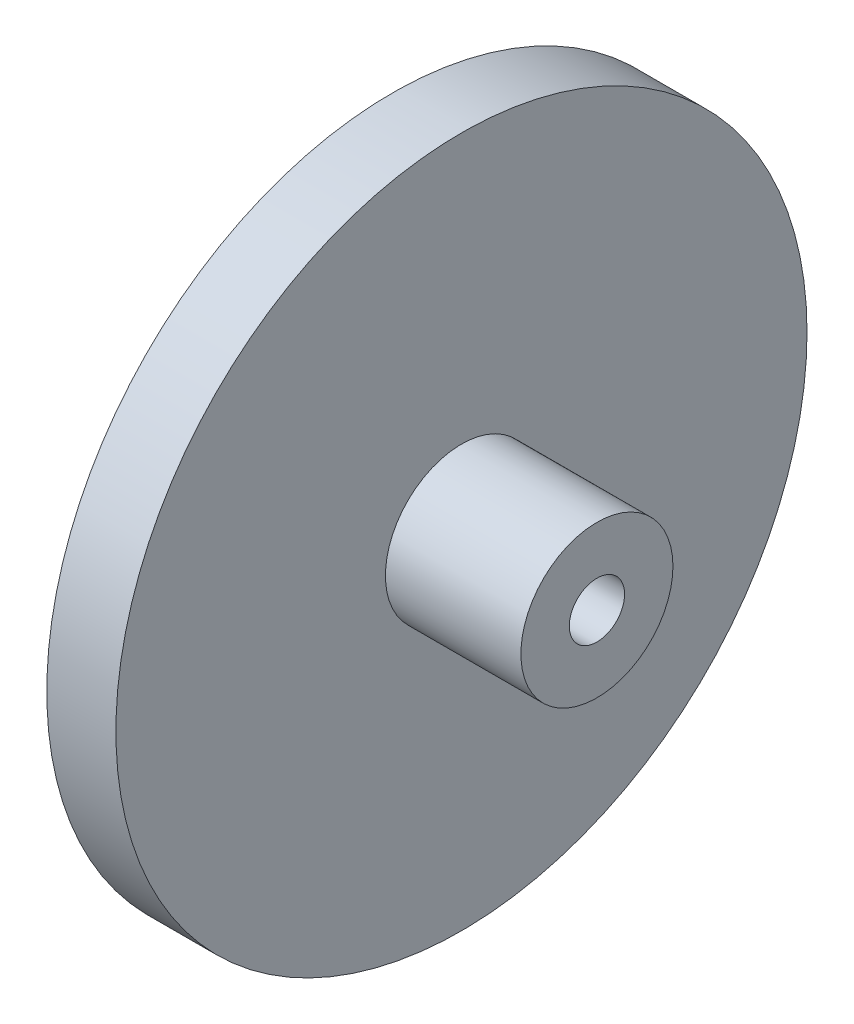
ISO-10303-21;
HEADER;
FILE_DESCRIPTION(('STEP AP214'),'2;1');
FILE_NAME('part.step','',(''),(''),'','','');
FILE_SCHEMA(('AUTOMOTIVE_DESIGN { 1 0 10303 214 1 1 1 1 }'));
ENDSEC;
DATA;
#1=APPLICATION_CONTEXT('core data for automotive mechanical design processes');
#2=APPLICATION_PROTOCOL_DEFINITION('international standard','automotive_design',2000,#1);
#3=PRODUCT_CONTEXT('',#1,'mechanical');
#4=PRODUCT('Part','Part','',(#3));
#5=PRODUCT_RELATED_PRODUCT_CATEGORY('part','',(#4));
#6=PRODUCT_DEFINITION_FORMATION('','',#4);
#7=PRODUCT_DEFINITION_CONTEXT('part definition',#1,'design');
#8=PRODUCT_DEFINITION('design','',#6,#7);
#9=PRODUCT_DEFINITION_SHAPE('','',#8);
#10=(LENGTH_UNIT() NAMED_UNIT(*) SI_UNIT(.MILLI.,.METRE.));
#11=(NAMED_UNIT(*) PLANE_ANGLE_UNIT() SI_UNIT($,.RADIAN.));
#12=(NAMED_UNIT(*) SI_UNIT($,.STERADIAN.) SOLID_ANGLE_UNIT());
#13=UNCERTAINTY_MEASURE_WITH_UNIT(LENGTH_MEASURE(1.E-05),#10,'distance_accuracy_value','');
#14=(GEOMETRIC_REPRESENTATION_CONTEXT(3) GLOBAL_UNCERTAINTY_ASSIGNED_CONTEXT((#13)) GLOBAL_UNIT_ASSIGNED_CONTEXT((#10,
#11,#12)) REPRESENTATION_CONTEXT('',''));
#15=CARTESIAN_POINT('',(0.,0.,0.));
#16=DIRECTION('',(0.,0.,1.));
#17=DIRECTION('',(1.,0.,0.));
#18=AXIS2_PLACEMENT_3D('',#15,#16,#17);
#19=CARTESIAN_POINT('',(-4.9,12.5,0.));
#20=DIRECTION('',(1.,0.,0.));
#21=DIRECTION('',(0.,0.,-1.));
#22=AXIS2_PLACEMENT_3D('',#19,#20,#21);
#23=PLANE('',#22);
#24=CARTESIAN_POINT('',(-4.9,0.,0.));
#25=DIRECTION('',(1.,0.,0.));
#26=DIRECTION('',(0.,0.,-1.));
#27=AXIS2_PLACEMENT_3D('',#24,#25,#26);
#28=CIRCLE('',#27,12.5);
#29=CARTESIAN_POINT('',(-4.9,0.,-12.5));
#30=VERTEX_POINT('',#29);
#31=EDGE_CURVE('E61',#30,#30,#28,.T.);
#32=ORIENTED_EDGE('',*,*,#31,.T.);
#33=EDGE_LOOP('',(#32));
#34=FACE_BOUND('',#33,.T.);
#35=CARTESIAN_POINT('',(-4.9,0.,0.));
#36=DIRECTION('',(1.,0.,0.));
#37=DIRECTION('',(0.,0.,-1.));
#38=AXIS2_PLACEMENT_3D('',#35,#36,#37);
#39=CIRCLE('',#38,2.75);
#40=CARTESIAN_POINT('',(-4.9,0.,-2.75));
#41=VERTEX_POINT('',#40);
#42=EDGE_CURVE('E10',#41,#41,#39,.T.);
#43=ORIENTED_EDGE('',*,*,#42,.F.);
#44=EDGE_LOOP('',(#43));
#45=FACE_BOUND('',#44,.T.);
#46=ADVANCED_FACE('F27',(#34,#45),#23,.T.);
#47=CARTESIAN_POINT('',(9.85897956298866,0.,0.));
#48=DIRECTION('',(1.,0.,0.));
#49=DIRECTION('',(0.,0.,-1.));
#50=AXIS2_PLACEMENT_3D('',#47,#48,#49);
#51=CYLINDRICAL_SURFACE('',#50,2.75);
#52=ORIENTED_EDGE('',*,*,#42,.T.);
#53=EDGE_LOOP('',(#52));
#54=FACE_BOUND('',#53,.T.);
#55=CARTESIAN_POINT('',(0.,0.,0.));
#56=DIRECTION('',(1.,0.,0.));
#57=DIRECTION('',(0.,0.,-1.));
#58=AXIS2_PLACEMENT_3D('',#55,#56,#57);
#59=CIRCLE('',#58,2.75);
#60=CARTESIAN_POINT('',(0.,0.,-2.75));
#61=VERTEX_POINT('',#60);
#62=EDGE_CURVE('E33',#61,#61,#59,.T.);
#63=ORIENTED_EDGE('',*,*,#62,.F.);
#64=EDGE_LOOP('',(#63));
#65=FACE_BOUND('',#64,.T.);
#66=ADVANCED_FACE('F79',(#54,#65),#51,.T.);
#67=CARTESIAN_POINT('',(0.,2.75,0.));
#68=DIRECTION('',(1.,0.,0.));
#69=DIRECTION('',(0.,0.,-1.));
#70=AXIS2_PLACEMENT_3D('',#67,#68,#69);
#71=PLANE('',#70);
#72=ORIENTED_EDGE('',*,*,#62,.T.);
#73=EDGE_LOOP('',(#72));
#74=FACE_BOUND('',#73,.T.);
#75=CARTESIAN_POINT('',(0.,0.,0.));
#76=DIRECTION('',(1.,0.,0.));
#77=DIRECTION('',(0.,0.,-1.));
#78=AXIS2_PLACEMENT_3D('',#75,#76,#77);
#79=CIRCLE('',#78,0.999999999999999);
#80=CARTESIAN_POINT('',(0.,0.,-0.999999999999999));
#81=VERTEX_POINT('',#80);
#82=EDGE_CURVE('E37',#81,#81,#79,.T.);
#83=ORIENTED_EDGE('',*,*,#82,.F.);
#84=EDGE_LOOP('',(#83));
#85=FACE_BOUND('',#84,.T.);
#86=ADVANCED_FACE('F83',(#74,#85),#71,.T.);
#87=CARTESIAN_POINT('',(9.85897956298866,0.,0.));
#88=DIRECTION('',(1.,0.,0.));
#89=DIRECTION('',(0.,0.,-1.));
#90=AXIS2_PLACEMENT_3D('',#87,#88,#89);
#91=CYLINDRICAL_SURFACE('',#90,0.999999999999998);
#92=ORIENTED_EDGE('',*,*,#82,.T.);
#93=EDGE_LOOP('',(#92));
#94=FACE_BOUND('',#93,.T.);
#95=CARTESIAN_POINT('',(-7.4,0.,0.));
#96=DIRECTION('',(1.,0.,0.));
#97=DIRECTION('',(0.,0.,-1.));
#98=AXIS2_PLACEMENT_3D('',#95,#96,#97);
#99=CIRCLE('',#98,0.999999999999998);
#100=CARTESIAN_POINT('',(-7.4,0.,-0.999999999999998));
#101=VERTEX_POINT('',#100);
#102=EDGE_CURVE('E41',#101,#101,#99,.T.);
#103=ORIENTED_EDGE('',*,*,#102,.F.);
#104=EDGE_LOOP('',(#103));
#105=FACE_BOUND('',#104,.T.);
#106=ADVANCED_FACE('F87',(#94,#105),#91,.F.);
#107=CARTESIAN_POINT('',(-7.4,0.999999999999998,0.));
#108=DIRECTION('',(-1.,0.,0.));
#109=DIRECTION('',(0.,0.,1.));
#110=AXIS2_PLACEMENT_3D('',#107,#108,#109);
#111=PLANE('',#110);
#112=ORIENTED_EDGE('',*,*,#102,.T.);
#113=EDGE_LOOP('',(#112));
#114=FACE_BOUND('',#113,.T.);
#115=CARTESIAN_POINT('',(-7.4,0.,0.));
#116=DIRECTION('',(1.,0.,0.));
#117=DIRECTION('',(0.,0.,-1.));
#118=AXIS2_PLACEMENT_3D('',#115,#116,#117);
#119=CIRCLE('',#118,2.95);
#120=CARTESIAN_POINT('',(-7.4,0.,-2.95));
#121=VERTEX_POINT('',#120);
#122=EDGE_CURVE('E46',#121,#121,#119,.T.);
#123=ORIENTED_EDGE('',*,*,#122,.F.);
#124=EDGE_LOOP('',(#123));
#125=FACE_BOUND('',#124,.T.);
#126=ADVANCED_FACE('F93',(#114,#125),#111,.T.);
#127=CARTESIAN_POINT('',(9.85897956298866,0.,0.));
#128=DIRECTION('',(1.,0.,0.));
#129=DIRECTION('',(0.,0.,-1.));
#130=AXIS2_PLACEMENT_3D('',#127,#128,#129);
#131=CYLINDRICAL_SURFACE('',#130,2.95);
#132=ORIENTED_EDGE('',*,*,#122,.T.);
#133=EDGE_LOOP('',(#132));
#134=FACE_BOUND('',#133,.T.);
#135=CARTESIAN_POINT('',(-6.4,0.,0.));
#136=DIRECTION('',(1.,0.,0.));
#137=DIRECTION('',(0.,0.,-1.));
#138=AXIS2_PLACEMENT_3D('',#135,#136,#137);
#139=CIRCLE('',#138,2.95);
#140=CARTESIAN_POINT('',(-6.4,0.,-2.95));
#141=VERTEX_POINT('',#140);
#142=EDGE_CURVE('E49',#141,#141,#139,.T.);
#143=ORIENTED_EDGE('',*,*,#142,.F.);
#144=EDGE_LOOP('',(#143));
#145=FACE_BOUND('',#144,.T.);
#146=ADVANCED_FACE('F97',(#134,#145),#131,.T.);
#147=CARTESIAN_POINT('',(-6.4,2.95,0.));
#148=DIRECTION('',(-1.,0.,0.));
#149=DIRECTION('',(0.,0.,1.));
#150=AXIS2_PLACEMENT_3D('',#147,#148,#149);
#151=PLANE('',#150);
#152=ORIENTED_EDGE('',*,*,#142,.T.);
#153=EDGE_LOOP('',(#152));
#154=FACE_BOUND('',#153,.T.);
#155=CARTESIAN_POINT('',(-6.4,0.,0.));
#156=DIRECTION('',(1.,0.,0.));
#157=DIRECTION('',(0.,0.,-1.));
#158=AXIS2_PLACEMENT_3D('',#155,#156,#157);
#159=CIRCLE('',#158,9.68);
#160=CARTESIAN_POINT('',(-6.4,0.,-9.68));
#161=VERTEX_POINT('',#160);
#162=EDGE_CURVE('E52',#161,#161,#159,.T.);
#163=ORIENTED_EDGE('',*,*,#162,.F.);
#164=EDGE_LOOP('',(#163));
#165=FACE_BOUND('',#164,.T.);
#166=ADVANCED_FACE('F101',(#154,#165),#151,.T.);
#167=CARTESIAN_POINT('',(-7.4,0.,0.));
#168=DIRECTION('',(-1.,0.,0.));
#169=DIRECTION('',(0.,0.,1.));
#170=AXIS2_PLACEMENT_3D('',#167,#168,#169);
#171=CONICAL_SURFACE('',#170,9.925,0.24026727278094);
#172=ORIENTED_EDGE('',*,*,#162,.T.);
#173=EDGE_LOOP('',(#172));
#174=FACE_BOUND('',#173,.T.);
#175=CARTESIAN_POINT('',(-7.4,0.,0.));
#176=DIRECTION('',(1.,0.,0.));
#177=DIRECTION('',(0.,0.,-1.));
#178=AXIS2_PLACEMENT_3D('',#175,#176,#177);
#179=CIRCLE('',#178,9.925);
#180=CARTESIAN_POINT('',(-7.4,0.,-9.925));
#181=VERTEX_POINT('',#180);
#182=EDGE_CURVE('E55',#181,#181,#179,.T.);
#183=ORIENTED_EDGE('',*,*,#182,.F.);
#184=EDGE_LOOP('',(#183));
#185=FACE_BOUND('',#184,.T.);
#186=ADVANCED_FACE('F75',(#174,#185),#171,.F.);
#187=CARTESIAN_POINT('',(-7.4,9.925,0.));
#188=DIRECTION('',(-1.,0.,0.));
#189=DIRECTION('',(0.,0.,1.));
#190=AXIS2_PLACEMENT_3D('',#187,#188,#189);
#191=PLANE('',#190);
#192=ORIENTED_EDGE('',*,*,#182,.T.);
#193=EDGE_LOOP('',(#192));
#194=FACE_BOUND('',#193,.T.);
#195=CARTESIAN_POINT('',(-7.4,0.,0.));
#196=DIRECTION('',(1.,0.,0.));
#197=DIRECTION('',(0.,0.,-1.));
#198=AXIS2_PLACEMENT_3D('',#195,#196,#197);
#199=CIRCLE('',#198,12.5);
#200=CARTESIAN_POINT('',(-7.4,0.,-12.5));
#201=VERTEX_POINT('',#200);
#202=EDGE_CURVE('E58',#201,#201,#199,.T.);
#203=ORIENTED_EDGE('',*,*,#202,.F.);
#204=EDGE_LOOP('',(#203));
#205=FACE_BOUND('',#204,.T.);
#206=ADVANCED_FACE('F69',(#194,#205),#191,.T.);
#207=CARTESIAN_POINT('',(9.85897956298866,0.,0.));
#208=DIRECTION('',(1.,0.,0.));
#209=DIRECTION('',(0.,0.,-1.));
#210=AXIS2_PLACEMENT_3D('',#207,#208,#209);
#211=CYLINDRICAL_SURFACE('',#210,12.5);
#212=ORIENTED_EDGE('',*,*,#202,.T.);
#213=EDGE_LOOP('',(#212));
#214=FACE_BOUND('',#213,.T.);
#215=ORIENTED_EDGE('',*,*,#31,.F.);
#216=EDGE_LOOP('',(#215));
#217=FACE_BOUND('',#216,.T.);
#218=ADVANCED_FACE('F67',(#214,#217),#211,.T.);
#219=CLOSED_SHELL('',(#46,#66,#86,#106,#126,#146,#166,#186,#206,#218));
#220=MANIFOLD_SOLID_BREP('B2',#219);
#221=ADVANCED_BREP_SHAPE_REPRESENTATION('',(#18,#220),#14);
#222=SHAPE_DEFINITION_REPRESENTATION(#9,#221);
ENDSEC;
END-ISO-10303-21;
